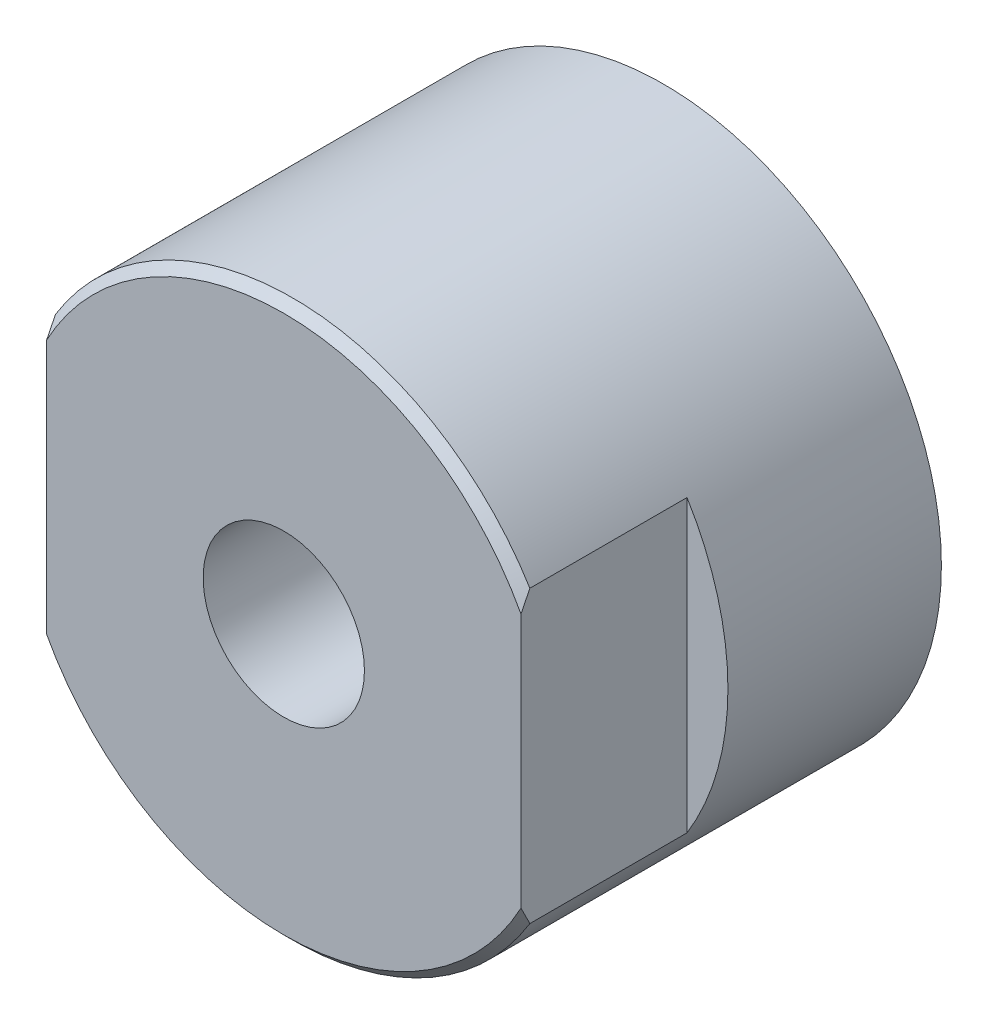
from build123d import *

# Parameters (mm, degrees)
SKETCH1_R          = 11.9126
BASE_EXTRUDE_DEPTH = 16.256
SKETCH2_R          = 3.4544
CUT_EXTRUDE1_DEPTH = 24.411057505
SKETCH3_R          = 4.2164
CUT_EXTRUDE2_DEPTH = 9.906
SKETCH4_R          = 8.3312
SKETCH4_R_2        = 6.2484
CUT_EXTRUDE3_DEPTH = 1.397
SKETCH5_W          = 11.511216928
SKETCH5_H          = 26.196210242
SKETCH5_W_2        = 12.767519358
CUT_EXTRUDE4_DEPTH = 7.112
CHAMFER1_SIZE      = 0.381
FILLET1_R          = 0.381
FILLET2_R          = 0.127


with BuildPart() as part:
    # Sketch1 → Base-Extrude (new body)
    with BuildSketch(Plane.XY):
        with Locations(Location((0, 0, 0), (0, 0, 211.473858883))):
            Circle(SKETCH1_R)
    extrude(amount=BASE_EXTRUDE_DEPTH)

    # Sketch2 → Cut-Extrude1 (cut, through all)
    with BuildSketch(Plane.XY.offset(16.256)):
        Circle(SKETCH2_R)
    extrude(amount=-CUT_EXTRUDE1_DEPTH, mode=Mode.SUBTRACT)

    # Sketch3 → Cut-Extrude2 (cut)
    with BuildSketch(Plane(origin=(0, 0, 0), x_dir=(-1, 0, 0), z_dir=(0, 0, -1))):
        Circle(SKETCH3_R)
    extrude(amount=-CUT_EXTRUDE2_DEPTH, mode=Mode.SUBTRACT)

    # Sketch4 → Cut-Extrude3 (cut)
    with BuildSketch(Plane(origin=(0, 0, 0), x_dir=(-1, 0, 0), z_dir=(0, 0, -1))):
        Circle(SKETCH4_R)
        Circle(SKETCH4_R_2, mode=Mode.SUBTRACT)
    extrude(amount=-CUT_EXTRUDE3_DEPTH, mode=Mode.SUBTRACT)

    # Sketch5 → Cut-Extrude4 (cut)
    with BuildSketch(Plane.XY.offset(16.256)):
        with Locations((15.915608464, -0.184156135)):
            Rectangle(SKETCH5_W, SKETCH5_H)
        with Locations((-16.543759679, -0.184156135)):
            Rectangle(SKETCH5_W_2, SKETCH5_H)
    extrude(amount=-CUT_EXTRUDE4_DEPTH, mode=Mode.SUBTRACT)

    # Chamfer1
    chamfer1_edges = [part.edges().sort_by_distance(p)[0] for p in [
        (0, 11.9126, 16.256),
        (0, -11.9126, 16.256),
    ]]
    chamfer(chamfer1_edges, length=CHAMFER1_SIZE)

    # Fillet1
    fillet1_edges = [part.edges().sort_by_distance(p)[0] for p in [
        (8.3312, 0, 1.397),
        (6.2484, 0, 1.397),
    ]]
    fillet(fillet1_edges, radius=FILLET1_R)

    # Fillet2
    fillet2_edges = [part.edges().sort_by_distance(p)[0] for p in [
        (8.3312, 0, 0),
        (6.2484, 0, 0),
    ]]
    fillet(fillet2_edges, radius=FILLET2_R)


solid = part.part
